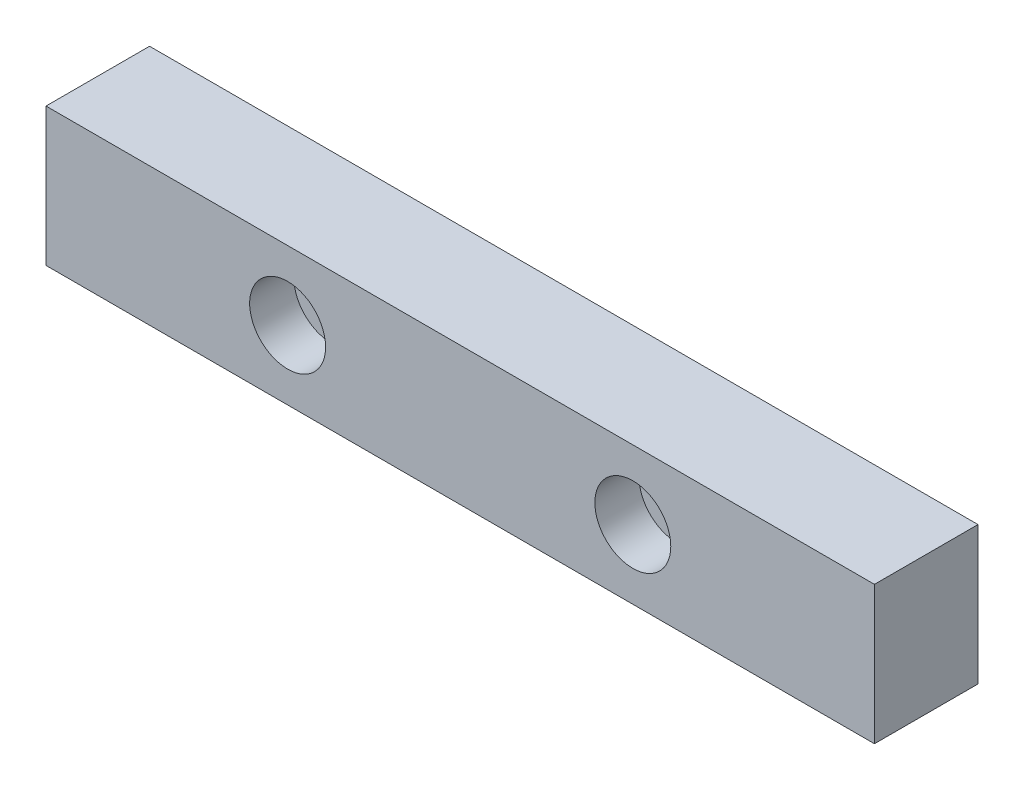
ISO-10303-21;
HEADER;
FILE_DESCRIPTION(('STEP AP214'),'2;1');
FILE_NAME('part.step','',(''),(''),'','','');
FILE_SCHEMA(('AUTOMOTIVE_DESIGN { 1 0 10303 214 1 1 1 1 }'));
ENDSEC;
DATA;
#1=APPLICATION_CONTEXT('core data for automotive mechanical design processes');
#2=APPLICATION_PROTOCOL_DEFINITION('international standard','automotive_design',2000,#1);
#3=PRODUCT_CONTEXT('',#1,'mechanical');
#4=PRODUCT('Part','Part','',(#3));
#5=PRODUCT_RELATED_PRODUCT_CATEGORY('part','',(#4));
#6=PRODUCT_DEFINITION_FORMATION('','',#4);
#7=PRODUCT_DEFINITION_CONTEXT('part definition',#1,'design');
#8=PRODUCT_DEFINITION('design','',#6,#7);
#9=PRODUCT_DEFINITION_SHAPE('','',#8);
#10=(LENGTH_UNIT() NAMED_UNIT(*) SI_UNIT(.MILLI.,.METRE.));
#11=(NAMED_UNIT(*) PLANE_ANGLE_UNIT() SI_UNIT($,.RADIAN.));
#12=(NAMED_UNIT(*) SI_UNIT($,.STERADIAN.) SOLID_ANGLE_UNIT());
#13=UNCERTAINTY_MEASURE_WITH_UNIT(LENGTH_MEASURE(1.E-05),#10,'distance_accuracy_value','');
#14=(GEOMETRIC_REPRESENTATION_CONTEXT(3) GLOBAL_UNCERTAINTY_ASSIGNED_CONTEXT((#13)) GLOBAL_UNIT_ASSIGNED_CONTEXT((#10,
#11,#12)) REPRESENTATION_CONTEXT('',''));
#15=CARTESIAN_POINT('',(0.,0.,0.));
#16=DIRECTION('',(0.,0.,1.));
#17=DIRECTION('',(1.,0.,0.));
#18=AXIS2_PLACEMENT_3D('',#15,#16,#17);
#19=CARTESIAN_POINT('',(0.,0.,15.));
#20=DIRECTION('',(-1.,0.,0.));
#21=DIRECTION('',(0.,0.,1.));
#22=AXIS2_PLACEMENT_3D('',#19,#20,#21);
#23=PLANE('',#22);
#24=DIRECTION('',(0.,1.,0.));
#25=VECTOR('',#24,1.);
#26=CARTESIAN_POINT('',(0.,0.,0.));
#27=LINE('',#26,#25);
#28=CARTESIAN_POINT('',(0.,0.,0.));
#29=VERTEX_POINT('',#28);
#30=CARTESIAN_POINT('',(0.,20.,0.));
#31=VERTEX_POINT('',#30);
#32=EDGE_CURVE('E96',#29,#31,#27,.T.);
#33=ORIENTED_EDGE('',*,*,#32,.T.);
#34=DIRECTION('',(0.,0.,-1.));
#35=VECTOR('',#34,1.);
#36=CARTESIAN_POINT('',(0.,20.,15.));
#37=LINE('',#36,#35);
#38=CARTESIAN_POINT('',(0.,20.,15.));
#39=VERTEX_POINT('',#38);
#40=EDGE_CURVE('E11',#39,#31,#37,.T.);
#41=ORIENTED_EDGE('',*,*,#40,.F.);
#42=DIRECTION('',(0.,1.,0.));
#43=VECTOR('',#42,1.);
#44=CARTESIAN_POINT('',(0.,0.,15.));
#45=LINE('',#44,#43);
#46=CARTESIAN_POINT('',(0.,0.,15.));
#47=VERTEX_POINT('',#46);
#48=EDGE_CURVE('E84',#47,#39,#45,.T.);
#49=ORIENTED_EDGE('',*,*,#48,.F.);
#50=DIRECTION('',(0.,0.,-1.));
#51=VECTOR('',#50,1.);
#52=CARTESIAN_POINT('',(0.,0.,15.));
#53=LINE('',#52,#51);
#54=EDGE_CURVE('E92',#47,#29,#53,.T.);
#55=ORIENTED_EDGE('',*,*,#54,.T.);
#56=EDGE_LOOP('',(#33,#41,#49,#55));
#57=FACE_BOUND('',#56,.T.);
#58=ADVANCED_FACE('F33',(#57),#23,.F.);
#59=CARTESIAN_POINT('',(0.,20.,15.));
#60=DIRECTION('',(0.,-1.,0.));
#61=DIRECTION('',(1.,0.,0.));
#62=AXIS2_PLACEMENT_3D('',#59,#60,#61);
#63=PLANE('',#62);
#64=DIRECTION('',(-1.,0.,0.));
#65=VECTOR('',#64,1.);
#66=CARTESIAN_POINT('',(0.,20.,0.));
#67=LINE('',#66,#65);
#68=CARTESIAN_POINT('',(-120.,20.,0.));
#69=VERTEX_POINT('',#68);
#70=EDGE_CURVE('E88',#31,#69,#67,.T.);
#71=ORIENTED_EDGE('',*,*,#70,.T.);
#72=DIRECTION('',(0.,0.,-1.));
#73=VECTOR('',#72,1.);
#74=CARTESIAN_POINT('',(-120.,20.,15.));
#75=LINE('',#74,#73);
#76=CARTESIAN_POINT('',(-120.,20.,15.));
#77=VERTEX_POINT('',#76);
#78=EDGE_CURVE('E41',#77,#69,#75,.T.);
#79=ORIENTED_EDGE('',*,*,#78,.F.);
#80=DIRECTION('',(-1.,0.,0.));
#81=VECTOR('',#80,1.);
#82=CARTESIAN_POINT('',(0.,20.,15.));
#83=LINE('',#82,#81);
#84=EDGE_CURVE('E79',#39,#77,#83,.T.);
#85=ORIENTED_EDGE('',*,*,#84,.F.);
#86=ORIENTED_EDGE('',*,*,#40,.T.);
#87=EDGE_LOOP('',(#71,#79,#85,#86));
#88=FACE_BOUND('',#87,.T.);
#89=ADVANCED_FACE('F87',(#88),#63,.F.);
#90=CARTESIAN_POINT('',(-120.,0.,15.));
#91=DIRECTION('',(1.,0.,0.));
#92=DIRECTION('',(0.,0.,-1.));
#93=AXIS2_PLACEMENT_3D('',#90,#91,#92);
#94=PLANE('',#93);
#95=DIRECTION('',(0.,-1.,0.));
#96=VECTOR('',#95,1.);
#97=CARTESIAN_POINT('',(-120.,0.,0.));
#98=LINE('',#97,#96);
#99=CARTESIAN_POINT('',(-120.,0.,0.));
#100=VERTEX_POINT('',#99);
#101=EDGE_CURVE('E66',#69,#100,#98,.T.);
#102=ORIENTED_EDGE('',*,*,#101,.T.);
#103=DIRECTION('',(0.,0.,-1.));
#104=VECTOR('',#103,1.);
#105=CARTESIAN_POINT('',(-120.,0.,15.));
#106=LINE('',#105,#104);
#107=CARTESIAN_POINT('',(-120.,0.,15.));
#108=VERTEX_POINT('',#107);
#109=EDGE_CURVE('E89',#108,#100,#106,.T.);
#110=ORIENTED_EDGE('',*,*,#109,.F.);
#111=DIRECTION('',(0.,-1.,0.));
#112=VECTOR('',#111,1.);
#113=CARTESIAN_POINT('',(-120.,0.,15.));
#114=LINE('',#113,#112);
#115=EDGE_CURVE('E82',#77,#108,#114,.T.);
#116=ORIENTED_EDGE('',*,*,#115,.F.);
#117=ORIENTED_EDGE('',*,*,#78,.T.);
#118=EDGE_LOOP('',(#102,#110,#116,#117));
#119=FACE_BOUND('',#118,.T.);
#120=ADVANCED_FACE('F90',(#119),#94,.F.);
#121=CARTESIAN_POINT('',(0.,0.,15.));
#122=DIRECTION('',(0.,1.,0.));
#123=DIRECTION('',(-1.,0.,0.));
#124=AXIS2_PLACEMENT_3D('',#121,#122,#123);
#125=PLANE('',#124);
#126=DIRECTION('',(1.,0.,0.));
#127=VECTOR('',#126,1.);
#128=CARTESIAN_POINT('',(0.,0.,0.));
#129=LINE('',#128,#127);
#130=EDGE_CURVE('E72',#100,#29,#129,.T.);
#131=ORIENTED_EDGE('',*,*,#130,.T.);
#132=ORIENTED_EDGE('',*,*,#54,.F.);
#133=DIRECTION('',(1.,0.,0.));
#134=VECTOR('',#133,1.);
#135=CARTESIAN_POINT('',(0.,0.,15.));
#136=LINE('',#135,#134);
#137=EDGE_CURVE('E49',#108,#47,#136,.T.);
#138=ORIENTED_EDGE('',*,*,#137,.F.);
#139=ORIENTED_EDGE('',*,*,#109,.T.);
#140=EDGE_LOOP('',(#131,#132,#138,#139));
#141=FACE_BOUND('',#140,.T.);
#142=ADVANCED_FACE('F104',(#141),#125,.F.);
#143=CARTESIAN_POINT('',(0.,0.,15.));
#144=DIRECTION('',(0.,0.,1.));
#145=DIRECTION('',(1.,0.,0.));
#146=AXIS2_PLACEMENT_3D('',#143,#144,#145);
#147=PLANE('',#146);
#148=CARTESIAN_POINT('',(-35.,9.99999999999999,15.));
#149=DIRECTION('',(0.,0.,1.));
#150=DIRECTION('',(1.,0.,0.));
#151=AXIS2_PLACEMENT_3D('',#148,#149,#150);
#152=CIRCLE('',#151,5.5);
#153=CARTESIAN_POINT('',(-29.5,9.99999999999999,15.));
#154=VERTEX_POINT('',#153);
#155=EDGE_CURVE('E130',#154,#154,#152,.T.);
#156=ORIENTED_EDGE('',*,*,#155,.F.);
#157=EDGE_LOOP('',(#156));
#158=FACE_BOUND('',#157,.T.);
#159=CARTESIAN_POINT('',(-85.,10.,15.));
#160=DIRECTION('',(0.,0.,1.));
#161=DIRECTION('',(1.,0.,0.));
#162=AXIS2_PLACEMENT_3D('',#159,#160,#161);
#163=CIRCLE('',#162,5.50000000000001);
#164=CARTESIAN_POINT('',(-79.5,10.,15.));
#165=VERTEX_POINT('',#164);
#166=EDGE_CURVE('E118',#165,#165,#163,.T.);
#167=ORIENTED_EDGE('',*,*,#166,.F.);
#168=EDGE_LOOP('',(#167));
#169=FACE_BOUND('',#168,.T.);
#170=ORIENTED_EDGE('',*,*,#48,.T.);
#171=ORIENTED_EDGE('',*,*,#84,.T.);
#172=ORIENTED_EDGE('',*,*,#115,.T.);
#173=ORIENTED_EDGE('',*,*,#137,.T.);
#174=EDGE_LOOP('',(#170,#171,#172,#173));
#175=FACE_BOUND('',#174,.T.);
#176=ADVANCED_FACE('F80',(#158,#169,#175),#147,.T.);
#177=CARTESIAN_POINT('',(0.,0.,0.));
#178=DIRECTION('',(0.,0.,1.));
#179=DIRECTION('',(1.,0.,0.));
#180=AXIS2_PLACEMENT_3D('',#177,#178,#179);
#181=PLANE('',#180);
#182=CARTESIAN_POINT('',(-35.,9.99999999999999,0.));
#183=DIRECTION('',(0.,0.,1.));
#184=DIRECTION('',(1.,0.,0.));
#185=AXIS2_PLACEMENT_3D('',#182,#183,#184);
#186=CIRCLE('',#185,3.3);
#187=CARTESIAN_POINT('',(-31.7,9.99999999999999,0.));
#188=VERTEX_POINT('',#187);
#189=EDGE_CURVE('E121',#188,#188,#186,.T.);
#190=ORIENTED_EDGE('',*,*,#189,.T.);
#191=EDGE_LOOP('',(#190));
#192=FACE_BOUND('',#191,.T.);
#193=CARTESIAN_POINT('',(-85.,10.,0.));
#194=DIRECTION('',(0.,0.,1.));
#195=DIRECTION('',(1.,0.,0.));
#196=AXIS2_PLACEMENT_3D('',#193,#194,#195);
#197=CIRCLE('',#196,3.3);
#198=CARTESIAN_POINT('',(-81.7,10.,0.));
#199=VERTEX_POINT('',#198);
#200=EDGE_CURVE('E99',#199,#199,#197,.T.);
#201=ORIENTED_EDGE('',*,*,#200,.T.);
#202=EDGE_LOOP('',(#201));
#203=FACE_BOUND('',#202,.T.);
#204=ORIENTED_EDGE('',*,*,#32,.F.);
#205=ORIENTED_EDGE('',*,*,#130,.F.);
#206=ORIENTED_EDGE('',*,*,#101,.F.);
#207=ORIENTED_EDGE('',*,*,#70,.F.);
#208=EDGE_LOOP('',(#204,#205,#206,#207));
#209=FACE_BOUND('',#208,.T.);
#210=ADVANCED_FACE('F107',(#192,#203,#209),#181,.F.);
#211=CARTESIAN_POINT('',(-85.,10.,15.));
#212=DIRECTION('',(0.,0.,1.));
#213=DIRECTION('',(1.,0.,0.));
#214=AXIS2_PLACEMENT_3D('',#211,#212,#213);
#215=CYLINDRICAL_SURFACE('',#214,3.3);
#216=ORIENTED_EDGE('',*,*,#200,.F.);
#217=EDGE_LOOP('',(#216));
#218=FACE_BOUND('',#217,.T.);
#219=CARTESIAN_POINT('',(-85.,10.,8.6));
#220=DIRECTION('',(0.,0.,1.));
#221=DIRECTION('',(1.,0.,0.));
#222=AXIS2_PLACEMENT_3D('',#219,#220,#221);
#223=CIRCLE('',#222,3.3);
#224=CARTESIAN_POINT('',(-81.7,10.,8.6));
#225=VERTEX_POINT('',#224);
#226=EDGE_CURVE('E112',#225,#225,#223,.T.);
#227=ORIENTED_EDGE('',*,*,#226,.T.);
#228=EDGE_LOOP('',(#227));
#229=FACE_BOUND('',#228,.T.);
#230=ADVANCED_FACE('F154',(#218,#229),#215,.F.);
#231=CARTESIAN_POINT('',(-81.7,10.,8.6));
#232=DIRECTION('',(0.,0.,-1.));
#233=DIRECTION('',(-1.,0.,0.));
#234=AXIS2_PLACEMENT_3D('',#231,#232,#233);
#235=PLANE('',#234);
#236=ORIENTED_EDGE('',*,*,#226,.F.);
#237=EDGE_LOOP('',(#236));
#238=FACE_BOUND('',#237,.T.);
#239=CARTESIAN_POINT('',(-85.,10.,8.6));
#240=DIRECTION('',(0.,0.,1.));
#241=DIRECTION('',(1.,0.,0.));
#242=AXIS2_PLACEMENT_3D('',#239,#240,#241);
#243=CIRCLE('',#242,5.50000000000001);
#244=CARTESIAN_POINT('',(-79.5,10.,8.6));
#245=VERTEX_POINT('',#244);
#246=EDGE_CURVE('E115',#245,#245,#243,.T.);
#247=ORIENTED_EDGE('',*,*,#246,.T.);
#248=EDGE_LOOP('',(#247));
#249=FACE_BOUND('',#248,.T.);
#250=ADVANCED_FACE('F144',(#238,#249),#235,.F.);
#251=CARTESIAN_POINT('',(-85.,10.,15.));
#252=DIRECTION('',(0.,0.,1.));
#253=DIRECTION('',(1.,0.,0.));
#254=AXIS2_PLACEMENT_3D('',#251,#252,#253);
#255=CYLINDRICAL_SURFACE('',#254,5.50000000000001);
#256=ORIENTED_EDGE('',*,*,#246,.F.);
#257=EDGE_LOOP('',(#256));
#258=FACE_BOUND('',#257,.T.);
#259=ORIENTED_EDGE('',*,*,#166,.T.);
#260=EDGE_LOOP('',(#259));
#261=FACE_BOUND('',#260,.T.);
#262=ADVANCED_FACE('F141',(#258,#261),#255,.F.);
#263=CARTESIAN_POINT('',(-35.,9.99999999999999,15.));
#264=DIRECTION('',(0.,0.,1.));
#265=DIRECTION('',(1.,0.,0.));
#266=AXIS2_PLACEMENT_3D('',#263,#264,#265);
#267=CYLINDRICAL_SURFACE('',#266,3.3);
#268=ORIENTED_EDGE('',*,*,#189,.F.);
#269=EDGE_LOOP('',(#268));
#270=FACE_BOUND('',#269,.T.);
#271=CARTESIAN_POINT('',(-35.,9.99999999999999,8.6));
#272=DIRECTION('',(0.,0.,1.));
#273=DIRECTION('',(1.,0.,0.));
#274=AXIS2_PLACEMENT_3D('',#271,#272,#273);
#275=CIRCLE('',#274,3.3);
#276=CARTESIAN_POINT('',(-31.7,9.99999999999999,8.6));
#277=VERTEX_POINT('',#276);
#278=EDGE_CURVE('E124',#277,#277,#275,.T.);
#279=ORIENTED_EDGE('',*,*,#278,.T.);
#280=EDGE_LOOP('',(#279));
#281=FACE_BOUND('',#280,.T.);
#282=ADVANCED_FACE('F143',(#270,#281),#267,.F.);
#283=CARTESIAN_POINT('',(-31.7,9.99999999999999,8.6));
#284=DIRECTION('',(0.,0.,-1.));
#285=DIRECTION('',(-1.,0.,0.));
#286=AXIS2_PLACEMENT_3D('',#283,#284,#285);
#287=PLANE('',#286);
#288=ORIENTED_EDGE('',*,*,#278,.F.);
#289=EDGE_LOOP('',(#288));
#290=FACE_BOUND('',#289,.T.);
#291=CARTESIAN_POINT('',(-35.,9.99999999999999,8.6));
#292=DIRECTION('',(0.,0.,1.));
#293=DIRECTION('',(1.,0.,0.));
#294=AXIS2_PLACEMENT_3D('',#291,#292,#293);
#295=CIRCLE('',#294,5.5);
#296=CARTESIAN_POINT('',(-29.5,9.99999999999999,8.6));
#297=VERTEX_POINT('',#296);
#298=EDGE_CURVE('E127',#297,#297,#295,.T.);
#299=ORIENTED_EDGE('',*,*,#298,.T.);
#300=EDGE_LOOP('',(#299));
#301=FACE_BOUND('',#300,.T.);
#302=ADVANCED_FACE('F151',(#290,#301),#287,.F.);
#303=CARTESIAN_POINT('',(-35.,9.99999999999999,15.));
#304=DIRECTION('',(0.,0.,1.));
#305=DIRECTION('',(1.,0.,0.));
#306=AXIS2_PLACEMENT_3D('',#303,#304,#305);
#307=CYLINDRICAL_SURFACE('',#306,5.5);
#308=ORIENTED_EDGE('',*,*,#298,.F.);
#309=EDGE_LOOP('',(#308));
#310=FACE_BOUND('',#309,.T.);
#311=ORIENTED_EDGE('',*,*,#155,.T.);
#312=EDGE_LOOP('',(#311));
#313=FACE_BOUND('',#312,.T.);
#314=ADVANCED_FACE('F134',(#310,#313),#307,.F.);
#315=CLOSED_SHELL('',(#58,#89,#120,#142,#176,#210,#230,#250,#262,#282,#302,#314));
#316=MANIFOLD_SOLID_BREP('B2',#315);
#317=ADVANCED_BREP_SHAPE_REPRESENTATION('',(#18,#316),#14);
#318=SHAPE_DEFINITION_REPRESENTATION(#9,#317);
ENDSEC;
END-ISO-10303-21;
